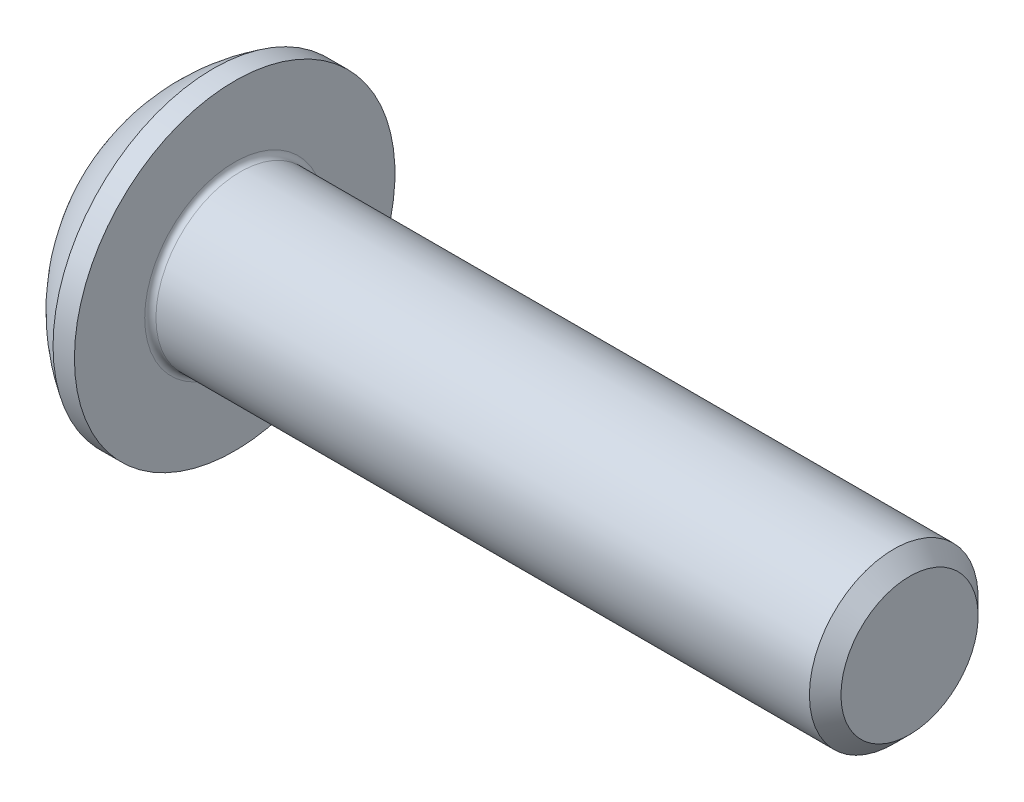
from build123d import *

# Parameters (mm, degrees)
FILLET1_R   = 0.1
HEX_2_DEPTH = 1.04


with BuildPart() as part:
    # BodySke → BaseBody (revolve)
    with BuildSketch(Plane.XY, mode=Mode.PRIVATE) as basebody_sk:
        with BuildLine():
            Line((13.65, 0), (13.65, 1.2195))
            Line((13.65, 1.2195), (13.3695, 1.5))
            Line((13.3695, 1.5), (1.65, 1.5))
            Line((1.65, 1.5), (1.65, 2.85))
            Line((1.65, 2.85), (1.27, 2.85))
            ThreePointArc((1.27, 2.85), (0.53140404, 2.229827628), (0, 1.425))
            Line((0, 1.425), (0, 0))
            Line((0, 0), (13.65, 0))
        make_face()
    revolve(basebody_sk.sketch.rotate(Axis((0, 0, 0), (1, 0, 0)), 90), axis=Axis((0, 0, 0), (1, 0, 0)))

    # Fillet1
    fillet1_edges = [part.edges().sort_by_distance(p)[0] for p in [
        (1.65, 0, -1.5),
    ]]
    fillet(fillet1_edges, radius=FILLET1_R)

    # Sketch2 → PreBroach (revolve, cut)
    with BuildSketch(Plane.XY, mode=Mode.PRIVATE) as prebroach_sk:
        Polygon((0, 1), (1.04, 1), (1.617350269, 0), (0, 0), align=None)
    revolve(prebroach_sk.sketch.rotate(Axis((0, 0, 0), (1, 0, 0)), 90), axis=Axis((0, 0, 0), (1, 0, 0)), mode=Mode.SUBTRACT)

    # Sketch3 → Hex 2 (cut)
    with BuildSketch(Plane(origin=(0, 0, 0), x_dir=(0, 0, -1), z_dir=(1, 0, 0))):
        Polygon((-1, -0.577350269), (-1, 0.577350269), (0, 1.154700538), (1, 0.577350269), (1, -0.577350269), (0, -1.154700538), align=None)
    extrude(amount=HEX_2_DEPTH, mode=Mode.SUBTRACT)


solid = part.part
